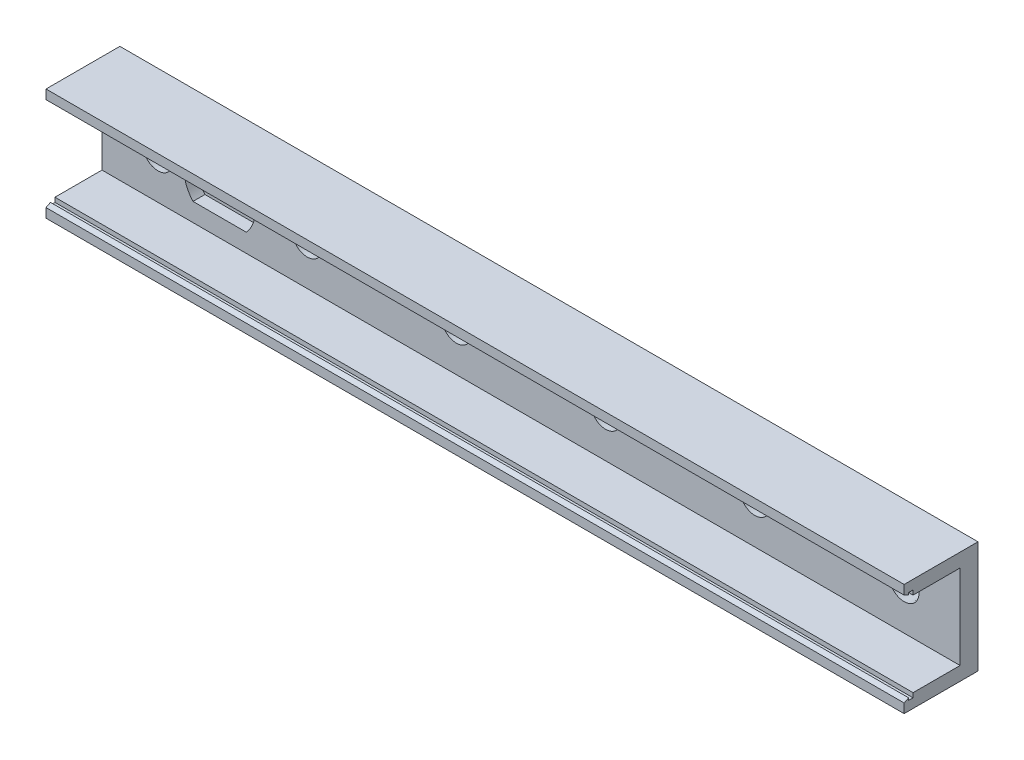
ISO-10303-21;
HEADER;
FILE_DESCRIPTION(('STEP AP214'),'2;1');
FILE_NAME('part.step','',(''),(''),'','','');
FILE_SCHEMA(('AUTOMOTIVE_DESIGN { 1 0 10303 214 1 1 1 1 }'));
ENDSEC;
DATA;
#1=APPLICATION_CONTEXT('core data for automotive mechanical design processes');
#2=APPLICATION_PROTOCOL_DEFINITION('international standard','automotive_design',2000,#1);
#3=PRODUCT_CONTEXT('',#1,'mechanical');
#4=PRODUCT('Part','Part','',(#3));
#5=PRODUCT_RELATED_PRODUCT_CATEGORY('part','',(#4));
#6=PRODUCT_DEFINITION_FORMATION('','',#4);
#7=PRODUCT_DEFINITION_CONTEXT('part definition',#1,'design');
#8=PRODUCT_DEFINITION('design','',#6,#7);
#9=PRODUCT_DEFINITION_SHAPE('','',#8);
#10=(LENGTH_UNIT() NAMED_UNIT(*) SI_UNIT(.MILLI.,.METRE.));
#11=(NAMED_UNIT(*) PLANE_ANGLE_UNIT() SI_UNIT($,.RADIAN.));
#12=(NAMED_UNIT(*) SI_UNIT($,.STERADIAN.) SOLID_ANGLE_UNIT());
#13=UNCERTAINTY_MEASURE_WITH_UNIT(LENGTH_MEASURE(1.E-05),#10,'distance_accuracy_value','');
#14=(GEOMETRIC_REPRESENTATION_CONTEXT(3) GLOBAL_UNCERTAINTY_ASSIGNED_CONTEXT((#13)) GLOBAL_UNIT_ASSIGNED_CONTEXT((#10,
#11,#12)) REPRESENTATION_CONTEXT('',''));
#15=CARTESIAN_POINT('',(0.,0.,0.));
#16=DIRECTION('',(0.,0.,1.));
#17=DIRECTION('',(1.,0.,0.));
#18=AXIS2_PLACEMENT_3D('',#15,#16,#17);
#19=CARTESIAN_POINT('',(0.,0.,3.048));
#20=DIRECTION('',(0.,0.,-1.));
#21=DIRECTION('',(-1.,0.,0.));
#22=AXIS2_PLACEMENT_3D('',#19,#20,#21);
#23=PLANE('',#22);
#24=DIRECTION('',(-1.,0.,0.));
#25=VECTOR('',#24,1.);
#26=CARTESIAN_POINT('',(15.4870030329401,13.589,3.048));
#27=LINE('',#26,#25);
#28=CARTESIAN_POINT('',(24.5743832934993,13.589,3.048));
#29=VERTEX_POINT('',#28);
#30=CARTESIAN_POINT('',(15.4870030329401,13.589,3.048));
#31=VERTEX_POINT('',#30);
#32=EDGE_CURVE('E293',#29,#31,#27,.T.);
#33=ORIENTED_EDGE('',*,*,#32,.F.);
#34=CARTESIAN_POINT('',(20.0306931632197,9.525,3.048));
#35=DIRECTION('',(0.,0.,1.));
#36=DIRECTION('',(1.,0.,0.));
#37=AXIS2_PLACEMENT_3D('',#34,#35,#36);
#38=CIRCLE('',#37,6.096);
#39=CARTESIAN_POINT('',(24.5743832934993,5.461,3.048));
#40=VERTEX_POINT('',#39);
#41=EDGE_CURVE('E296',#40,#29,#38,.T.);
#42=ORIENTED_EDGE('',*,*,#41,.F.);
#43=DIRECTION('',(1.,0.,0.));
#44=VECTOR('',#43,1.);
#45=CARTESIAN_POINT('',(15.4870030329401,5.461,3.048));
#46=LINE('',#45,#44);
#47=CARTESIAN_POINT('',(15.4870030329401,5.461,3.048));
#48=VERTEX_POINT('',#47);
#49=EDGE_CURVE('E286',#48,#40,#46,.T.);
#50=ORIENTED_EDGE('',*,*,#49,.F.);
#51=CARTESIAN_POINT('',(20.0306931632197,9.525,3.048));
#52=DIRECTION('',(0.,0.,1.));
#53=DIRECTION('',(1.,0.,0.));
#54=AXIS2_PLACEMENT_3D('',#51,#52,#53);
#55=CIRCLE('',#54,6.096);
#56=EDGE_CURVE('E290',#31,#48,#55,.T.);
#57=ORIENTED_EDGE('',*,*,#56,.F.);
#58=EDGE_LOOP('',(#33,#42,#50,#57));
#59=FACE_BOUND('',#58,.T.);
#60=CARTESIAN_POINT('',(9.525,9.525,3.048));
#61=DIRECTION('',(0.,0.,1.));
#62=DIRECTION('',(1.,0.,0.));
#63=AXIS2_PLACEMENT_3D('',#60,#61,#62);
#64=CIRCLE('',#63,2.54);
#65=CARTESIAN_POINT('',(12.065,9.525,3.048));
#66=VERTEX_POINT('',#65);
#67=EDGE_CURVE('E317',#66,#66,#64,.T.);
#68=ORIENTED_EDGE('',*,*,#67,.F.);
#69=EDGE_LOOP('',(#68));
#70=FACE_BOUND('',#69,.T.);
#71=CARTESIAN_POINT('',(34.925,9.525,3.048));
#72=DIRECTION('',(0.,0.,1.));
#73=DIRECTION('',(1.,0.,0.));
#74=AXIS2_PLACEMENT_3D('',#71,#72,#73);
#75=CIRCLE('',#74,2.54);
#76=CARTESIAN_POINT('',(37.465,9.525,3.048));
#77=VERTEX_POINT('',#76);
#78=EDGE_CURVE('E323',#77,#77,#75,.T.);
#79=ORIENTED_EDGE('',*,*,#78,.F.);
#80=EDGE_LOOP('',(#79));
#81=FACE_BOUND('',#80,.T.);
#82=CARTESIAN_POINT('',(60.325,9.525,3.048));
#83=DIRECTION('',(0.,0.,1.));
#84=DIRECTION('',(1.,0.,0.));
#85=AXIS2_PLACEMENT_3D('',#82,#83,#84);
#86=CIRCLE('',#85,2.54);
#87=CARTESIAN_POINT('',(62.865,9.525,3.048));
#88=VERTEX_POINT('',#87);
#89=EDGE_CURVE('E329',#88,#88,#86,.T.);
#90=ORIENTED_EDGE('',*,*,#89,.F.);
#91=EDGE_LOOP('',(#90));
#92=FACE_BOUND('',#91,.T.);
#93=CARTESIAN_POINT('',(85.725,9.525,3.048));
#94=DIRECTION('',(0.,0.,1.));
#95=DIRECTION('',(1.,0.,0.));
#96=AXIS2_PLACEMENT_3D('',#93,#94,#95);
#97=CIRCLE('',#96,2.54);
#98=CARTESIAN_POINT('',(88.265,9.525,3.048));
#99=VERTEX_POINT('',#98);
#100=EDGE_CURVE('E335',#99,#99,#97,.T.);
#101=ORIENTED_EDGE('',*,*,#100,.F.);
#102=EDGE_LOOP('',(#101));
#103=FACE_BOUND('',#102,.T.);
#104=CARTESIAN_POINT('',(111.125,9.525,3.048));
#105=DIRECTION('',(0.,0.,1.));
#106=DIRECTION('',(1.,0.,0.));
#107=AXIS2_PLACEMENT_3D('',#104,#105,#106);
#108=CIRCLE('',#107,2.54);
#109=CARTESIAN_POINT('',(113.665,9.525,3.048));
#110=VERTEX_POINT('',#109);
#111=EDGE_CURVE('E341',#110,#110,#108,.T.);
#112=ORIENTED_EDGE('',*,*,#111,.F.);
#113=EDGE_LOOP('',(#112));
#114=FACE_BOUND('',#113,.T.);
#115=CARTESIAN_POINT('',(136.525,9.525,3.048));
#116=DIRECTION('',(0.,0.,1.));
#117=DIRECTION('',(1.,0.,0.));
#118=AXIS2_PLACEMENT_3D('',#115,#116,#117);
#119=CIRCLE('',#118,2.54000000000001);
#120=CARTESIAN_POINT('',(139.065,9.525,3.048));
#121=VERTEX_POINT('',#120);
#122=EDGE_CURVE('E347',#121,#121,#119,.T.);
#123=ORIENTED_EDGE('',*,*,#122,.F.);
#124=EDGE_LOOP('',(#123));
#125=FACE_BOUND('',#124,.T.);
#126=DIRECTION('',(-1.,0.,0.));
#127=VECTOR('',#126,1.);
#128=CARTESIAN_POINT('',(146.05,2.33679999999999,3.048));
#129=LINE('',#128,#127);
#130=CARTESIAN_POINT('',(146.05,2.3368,3.048));
#131=VERTEX_POINT('',#130);
#132=CARTESIAN_POINT('',(0.,2.3368,3.048));
#133=VERTEX_POINT('',#132);
#134=EDGE_CURVE('E55',#131,#133,#129,.T.);
#135=ORIENTED_EDGE('',*,*,#134,.F.);
#136=DIRECTION('',(0.,1.,0.));
#137=VECTOR('',#136,1.);
#138=CARTESIAN_POINT('',(146.05,0.,3.048));
#139=LINE('',#138,#137);
#140=CARTESIAN_POINT('',(146.05,16.7132,3.048));
#141=VERTEX_POINT('',#140);
#142=EDGE_CURVE('E37',#131,#141,#139,.T.);
#143=ORIENTED_EDGE('',*,*,#142,.T.);
#144=DIRECTION('',(-1.,0.,0.));
#145=VECTOR('',#144,1.);
#146=CARTESIAN_POINT('',(146.05,16.7132,3.048));
#147=LINE('',#146,#145);
#148=CARTESIAN_POINT('',(0.,16.7132,3.048));
#149=VERTEX_POINT('',#148);
#150=EDGE_CURVE('E226',#141,#149,#147,.T.);
#151=ORIENTED_EDGE('',*,*,#150,.T.);
#152=DIRECTION('',(0.,-1.,0.));
#153=VECTOR('',#152,1.);
#154=CARTESIAN_POINT('',(0.,0.,3.048));
#155=LINE('',#154,#153);
#156=EDGE_CURVE('E51',#149,#133,#155,.T.);
#157=ORIENTED_EDGE('',*,*,#156,.T.);
#158=EDGE_LOOP('',(#135,#143,#151,#157));
#159=FACE_BOUND('',#158,.T.);
#160=ADVANCED_FACE('F33',(#59,#70,#81,#92,#103,#114,#125,#159),#23,.F.);
#161=CARTESIAN_POINT('',(0.,0.,3.048));
#162=DIRECTION('',(1.,0.,0.));
#163=DIRECTION('',(0.,0.,-1.));
#164=AXIS2_PLACEMENT_3D('',#161,#162,#163);
#165=PLANE('',#164);
#166=DIRECTION('',(0.,-1.,0.));
#167=VECTOR('',#166,1.);
#168=CARTESIAN_POINT('',(0.,0.,0.));
#169=LINE('',#168,#167);
#170=CARTESIAN_POINT('',(0.,19.05,0.));
#171=VERTEX_POINT('',#170);
#172=CARTESIAN_POINT('',(0.,0.,0.));
#173=VERTEX_POINT('',#172);
#174=EDGE_CURVE('E271',#171,#173,#169,.T.);
#175=ORIENTED_EDGE('',*,*,#174,.T.);
#176=DIRECTION('',(0.,0.,-1.));
#177=VECTOR('',#176,1.);
#178=CARTESIAN_POINT('',(0.,0.,3.048));
#179=LINE('',#178,#177);
#180=CARTESIAN_POINT('',(0.,0.,12.573));
#181=VERTEX_POINT('',#180);
#182=EDGE_CURVE('E11',#181,#173,#179,.T.);
#183=ORIENTED_EDGE('',*,*,#182,.F.);
#184=DIRECTION('',(0.,-1.,0.));
#185=VECTOR('',#184,1.);
#186=CARTESIAN_POINT('',(0.,0.,12.573));
#187=LINE('',#186,#185);
#188=CARTESIAN_POINT('',(0.,1.5748,12.573));
#189=VERTEX_POINT('',#188);
#190=EDGE_CURVE('E189',#189,#181,#187,.T.);
#191=ORIENTED_EDGE('',*,*,#190,.F.);
#192=DIRECTION('',(0.,-0.447213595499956,0.894427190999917));
#193=VECTOR('',#192,1.);
#194=CARTESIAN_POINT('',(0.,1.5748,12.573));
#195=LINE('',#194,#193);
#196=CARTESIAN_POINT('',(0.,1.9558,11.811));
#197=VERTEX_POINT('',#196);
#198=EDGE_CURVE('E494',#197,#189,#195,.T.);
#199=ORIENTED_EDGE('',*,*,#198,.F.);
#200=DIRECTION('',(0.,1.,0.));
#201=VECTOR('',#200,1.);
#202=CARTESIAN_POINT('',(0.,1.9558,11.811));
#203=LINE('',#202,#201);
#204=CARTESIAN_POINT('',(0.,1.5748,11.811));
#205=VERTEX_POINT('',#204);
#206=EDGE_CURVE('E507',#205,#197,#203,.T.);
#207=ORIENTED_EDGE('',*,*,#206,.F.);
#208=DIRECTION('',(0.,0.,1.));
#209=VECTOR('',#208,1.);
#210=CARTESIAN_POINT('',(0.,1.5748,11.811));
#211=LINE('',#210,#209);
#212=CARTESIAN_POINT('',(0.,1.5748,11.049));
#213=VERTEX_POINT('',#212);
#214=EDGE_CURVE('E510',#213,#205,#211,.T.);
#215=ORIENTED_EDGE('',*,*,#214,.F.);
#216=DIRECTION('',(0.,-1.,0.));
#217=VECTOR('',#216,1.);
#218=CARTESIAN_POINT('',(0.,2.3368,11.049));
#219=LINE('',#218,#217);
#220=CARTESIAN_POINT('',(0.,2.3368,11.049));
#221=VERTEX_POINT('',#220);
#222=EDGE_CURVE('E513',#221,#213,#219,.T.);
#223=ORIENTED_EDGE('',*,*,#222,.F.);
#224=DIRECTION('',(0.,0.,1.));
#225=VECTOR('',#224,1.);
#226=CARTESIAN_POINT('',(0.,2.3368,11.049));
#227=LINE('',#226,#225);
#228=EDGE_CURVE('E193',#133,#221,#227,.T.);
#229=ORIENTED_EDGE('',*,*,#228,.F.);
#230=ORIENTED_EDGE('',*,*,#156,.F.);
#231=DIRECTION('',(0.,0.,-1.));
#232=VECTOR('',#231,1.);
#233=CARTESIAN_POINT('',(0.,16.7132,11.049));
#234=LINE('',#233,#232);
#235=CARTESIAN_POINT('',(0.,16.7132,11.049));
#236=VERTEX_POINT('',#235);
#237=EDGE_CURVE('E205',#236,#149,#234,.T.);
#238=ORIENTED_EDGE('',*,*,#237,.F.);
#239=DIRECTION('',(0.,-1.,0.));
#240=VECTOR('',#239,1.);
#241=CARTESIAN_POINT('',(0.,16.7132,11.049));
#242=LINE('',#241,#240);
#243=CARTESIAN_POINT('',(0.,17.4752,11.049));
#244=VERTEX_POINT('',#243);
#245=EDGE_CURVE('E219',#244,#236,#242,.T.);
#246=ORIENTED_EDGE('',*,*,#245,.F.);
#247=DIRECTION('',(0.,0.,-1.));
#248=VECTOR('',#247,1.);
#249=CARTESIAN_POINT('',(0.,17.4752,11.811));
#250=LINE('',#249,#248);
#251=CARTESIAN_POINT('',(0.,17.4752,11.811));
#252=VERTEX_POINT('',#251);
#253=EDGE_CURVE('E217',#252,#244,#250,.T.);
#254=ORIENTED_EDGE('',*,*,#253,.F.);
#255=DIRECTION('',(0.,1.,0.));
#256=VECTOR('',#255,1.);
#257=CARTESIAN_POINT('',(0.,17.0942,11.811));
#258=LINE('',#257,#256);
#259=CARTESIAN_POINT('',(0.,17.0942,11.811));
#260=VERTEX_POINT('',#259);
#261=EDGE_CURVE('E215',#260,#252,#258,.T.);
#262=ORIENTED_EDGE('',*,*,#261,.F.);
#263=DIRECTION('',(0.,-0.447213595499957,-0.894427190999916));
#264=VECTOR('',#263,1.);
#265=CARTESIAN_POINT('',(0.,17.4752,12.573));
#266=LINE('',#265,#264);
#267=CARTESIAN_POINT('',(0.,17.4752,12.573));
#268=VERTEX_POINT('',#267);
#269=EDGE_CURVE('E196',#268,#260,#266,.T.);
#270=ORIENTED_EDGE('',*,*,#269,.F.);
#271=DIRECTION('',(0.,-1.,0.));
#272=VECTOR('',#271,1.);
#273=CARTESIAN_POINT('',(0.,19.05,12.573));
#274=LINE('',#273,#272);
#275=CARTESIAN_POINT('',(0.,19.05,12.573));
#276=VERTEX_POINT('',#275);
#277=EDGE_CURVE('E194',#276,#268,#274,.T.);
#278=ORIENTED_EDGE('',*,*,#277,.F.);
#279=DIRECTION('',(0.,0.,-1.));
#280=VECTOR('',#279,1.);
#281=CARTESIAN_POINT('',(0.,19.05,3.048));
#282=LINE('',#281,#280);
#283=EDGE_CURVE('E246',#276,#171,#282,.T.);
#284=ORIENTED_EDGE('',*,*,#283,.T.);
#285=EDGE_LOOP('',(#175,#183,#191,#199,#207,#215,#223,#229,#230,#238,#246,#254,#262,#270,#278,#284));
#286=FACE_BOUND('',#285,.T.);
#287=ADVANCED_FACE('F35',(#286),#165,.F.);
#288=CARTESIAN_POINT('',(0.,0.,3.048));
#289=DIRECTION('',(0.,1.,0.));
#290=DIRECTION('',(0.,0.,1.));
#291=AXIS2_PLACEMENT_3D('',#288,#289,#290);
#292=PLANE('',#291);
#293=DIRECTION('',(1.,0.,0.));
#294=VECTOR('',#293,1.);
#295=CARTESIAN_POINT('',(0.,0.,0.));
#296=LINE('',#295,#294);
#297=CARTESIAN_POINT('',(146.05,0.,0.));
#298=VERTEX_POINT('',#297);
#299=EDGE_CURVE('E253',#173,#298,#296,.T.);
#300=ORIENTED_EDGE('',*,*,#299,.T.);
#301=DIRECTION('',(0.,0.,-1.));
#302=VECTOR('',#301,1.);
#303=CARTESIAN_POINT('',(146.05,0.,3.048));
#304=LINE('',#303,#302);
#305=CARTESIAN_POINT('',(146.05,0.,12.573));
#306=VERTEX_POINT('',#305);
#307=EDGE_CURVE('E43',#306,#298,#304,.T.);
#308=ORIENTED_EDGE('',*,*,#307,.F.);
#309=DIRECTION('',(-1.,0.,0.));
#310=VECTOR('',#309,1.);
#311=CARTESIAN_POINT('',(146.05,0.,12.573));
#312=LINE('',#311,#310);
#313=EDGE_CURVE('E490',#306,#181,#312,.T.);
#314=ORIENTED_EDGE('',*,*,#313,.T.);
#315=ORIENTED_EDGE('',*,*,#182,.T.);
#316=EDGE_LOOP('',(#300,#308,#314,#315));
#317=FACE_BOUND('',#316,.T.);
#318=ADVANCED_FACE('F396',(#317),#292,.F.);
#319=CARTESIAN_POINT('',(146.05,0.,3.048));
#320=DIRECTION('',(-1.,0.,0.));
#321=DIRECTION('',(0.,0.,1.));
#322=AXIS2_PLACEMENT_3D('',#319,#320,#321);
#323=PLANE('',#322);
#324=DIRECTION('',(0.,1.,0.));
#325=VECTOR('',#324,1.);
#326=CARTESIAN_POINT('',(146.05,0.,0.));
#327=LINE('',#326,#325);
#328=CARTESIAN_POINT('',(146.05,19.05,0.));
#329=VERTEX_POINT('',#328);
#330=EDGE_CURVE('E247',#298,#329,#327,.T.);
#331=ORIENTED_EDGE('',*,*,#330,.T.);
#332=DIRECTION('',(0.,0.,-1.));
#333=VECTOR('',#332,1.);
#334=CARTESIAN_POINT('',(146.05,19.05,3.048));
#335=LINE('',#334,#333);
#336=CARTESIAN_POINT('',(146.05,19.05,12.573));
#337=VERTEX_POINT('',#336);
#338=EDGE_CURVE('E258',#337,#329,#335,.T.);
#339=ORIENTED_EDGE('',*,*,#338,.F.);
#340=DIRECTION('',(0.,-1.,0.));
#341=VECTOR('',#340,1.);
#342=CARTESIAN_POINT('',(146.05,19.05,12.573));
#343=LINE('',#342,#341);
#344=CARTESIAN_POINT('',(146.05,17.4752,12.573));
#345=VERTEX_POINT('',#344);
#346=EDGE_CURVE('E202',#337,#345,#343,.T.);
#347=ORIENTED_EDGE('',*,*,#346,.T.);
#348=DIRECTION('',(0.,-0.447213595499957,-0.894427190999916));
#349=VECTOR('',#348,1.);
#350=CARTESIAN_POINT('',(146.05,17.4752,12.573));
#351=LINE('',#350,#349);
#352=CARTESIAN_POINT('',(146.05,17.0942,11.811));
#353=VERTEX_POINT('',#352);
#354=EDGE_CURVE('E204',#345,#353,#351,.T.);
#355=ORIENTED_EDGE('',*,*,#354,.T.);
#356=DIRECTION('',(0.,1.,0.));
#357=VECTOR('',#356,1.);
#358=CARTESIAN_POINT('',(146.05,17.0942,11.811));
#359=LINE('',#358,#357);
#360=CARTESIAN_POINT('',(146.05,17.4752,11.811));
#361=VERTEX_POINT('',#360);
#362=EDGE_CURVE('E207',#353,#361,#359,.T.);
#363=ORIENTED_EDGE('',*,*,#362,.T.);
#364=DIRECTION('',(0.,0.,-1.));
#365=VECTOR('',#364,1.);
#366=CARTESIAN_POINT('',(146.05,17.4752,11.811));
#367=LINE('',#366,#365);
#368=CARTESIAN_POINT('',(146.05,17.4752,11.049));
#369=VERTEX_POINT('',#368);
#370=EDGE_CURVE('E209',#361,#369,#367,.T.);
#371=ORIENTED_EDGE('',*,*,#370,.T.);
#372=DIRECTION('',(0.,-1.,0.));
#373=VECTOR('',#372,1.);
#374=CARTESIAN_POINT('',(146.05,16.7132,11.049));
#375=LINE('',#374,#373);
#376=CARTESIAN_POINT('',(146.05,16.7132,11.049));
#377=VERTEX_POINT('',#376);
#378=EDGE_CURVE('E211',#369,#377,#375,.T.);
#379=ORIENTED_EDGE('',*,*,#378,.T.);
#380=DIRECTION('',(0.,0.,-1.));
#381=VECTOR('',#380,1.);
#382=CARTESIAN_POINT('',(146.05,16.7132,11.049));
#383=LINE('',#382,#381);
#384=EDGE_CURVE('E212',#377,#141,#383,.T.);
#385=ORIENTED_EDGE('',*,*,#384,.T.);
#386=ORIENTED_EDGE('',*,*,#142,.F.);
#387=DIRECTION('',(0.,0.,1.));
#388=VECTOR('',#387,1.);
#389=CARTESIAN_POINT('',(146.05,2.3368,11.049));
#390=LINE('',#389,#388);
#391=CARTESIAN_POINT('',(146.05,2.3368,11.049));
#392=VERTEX_POINT('',#391);
#393=EDGE_CURVE('E183',#131,#392,#390,.T.);
#394=ORIENTED_EDGE('',*,*,#393,.T.);
#395=DIRECTION('',(0.,-1.,0.));
#396=VECTOR('',#395,1.);
#397=CARTESIAN_POINT('',(146.05,2.3368,11.049));
#398=LINE('',#397,#396);
#399=CARTESIAN_POINT('',(146.05,1.5748,11.049));
#400=VERTEX_POINT('',#399);
#401=EDGE_CURVE('E172',#392,#400,#398,.T.);
#402=ORIENTED_EDGE('',*,*,#401,.T.);
#403=DIRECTION('',(0.,0.,1.));
#404=VECTOR('',#403,1.);
#405=CARTESIAN_POINT('',(146.05,1.5748,11.811));
#406=LINE('',#405,#404);
#407=CARTESIAN_POINT('',(146.05,1.5748,11.811));
#408=VERTEX_POINT('',#407);
#409=EDGE_CURVE('E182',#400,#408,#406,.T.);
#410=ORIENTED_EDGE('',*,*,#409,.T.);
#411=DIRECTION('',(0.,1.,0.));
#412=VECTOR('',#411,1.);
#413=CARTESIAN_POINT('',(146.05,1.9558,11.811));
#414=LINE('',#413,#412);
#415=CARTESIAN_POINT('',(146.05,1.9558,11.811));
#416=VERTEX_POINT('',#415);
#417=EDGE_CURVE('E508',#408,#416,#414,.T.);
#418=ORIENTED_EDGE('',*,*,#417,.T.);
#419=DIRECTION('',(0.,-0.447213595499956,0.894427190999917));
#420=VECTOR('',#419,1.);
#421=CARTESIAN_POINT('',(146.05,1.5748,12.573));
#422=LINE('',#421,#420);
#423=CARTESIAN_POINT('',(146.05,1.5748,12.573));
#424=VERTEX_POINT('',#423);
#425=EDGE_CURVE('E519',#416,#424,#422,.T.);
#426=ORIENTED_EDGE('',*,*,#425,.T.);
#427=DIRECTION('',(0.,-1.,0.));
#428=VECTOR('',#427,1.);
#429=CARTESIAN_POINT('',(146.05,0.,12.573));
#430=LINE('',#429,#428);
#431=EDGE_CURVE('E264',#424,#306,#430,.T.);
#432=ORIENTED_EDGE('',*,*,#431,.T.);
#433=ORIENTED_EDGE('',*,*,#307,.T.);
#434=EDGE_LOOP('',(#331,#339,#347,#355,#363,#371,#379,#385,#386,#394,#402,#410,#418,#426,#432,#433));
#435=FACE_BOUND('',#434,.T.);
#436=ADVANCED_FACE('F186',(#435),#323,.F.);
#437=CARTESIAN_POINT('',(0.,19.05,3.048));
#438=DIRECTION('',(0.,-1.,0.));
#439=DIRECTION('',(0.,0.,-1.));
#440=AXIS2_PLACEMENT_3D('',#437,#438,#439);
#441=PLANE('',#440);
#442=DIRECTION('',(-1.,0.,0.));
#443=VECTOR('',#442,1.);
#444=CARTESIAN_POINT('',(0.,19.05,0.));
#445=LINE('',#444,#443);
#446=EDGE_CURVE('E245',#329,#171,#445,.T.);
#447=ORIENTED_EDGE('',*,*,#446,.T.);
#448=ORIENTED_EDGE('',*,*,#283,.F.);
#449=DIRECTION('',(-1.,0.,0.));
#450=VECTOR('',#449,1.);
#451=CARTESIAN_POINT('',(146.05,19.05,12.573));
#452=LINE('',#451,#450);
#453=EDGE_CURVE('E350',#337,#276,#452,.T.);
#454=ORIENTED_EDGE('',*,*,#453,.F.);
#455=ORIENTED_EDGE('',*,*,#338,.T.);
#456=EDGE_LOOP('',(#447,#448,#454,#455));
#457=FACE_BOUND('',#456,.T.);
#458=ADVANCED_FACE('F386',(#457),#441,.F.);
#459=CARTESIAN_POINT('',(0.,0.,0.));
#460=DIRECTION('',(0.,0.,-1.));
#461=DIRECTION('',(-1.,0.,0.));
#462=AXIS2_PLACEMENT_3D('',#459,#460,#461);
#463=PLANE('',#462);
#464=CARTESIAN_POINT('',(136.525,9.525,0.));
#465=DIRECTION('',(0.,0.,1.));
#466=DIRECTION('',(1.,0.,0.));
#467=AXIS2_PLACEMENT_3D('',#464,#465,#466);
#468=CIRCLE('',#467,2.69973891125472);
#469=CARTESIAN_POINT('',(139.224738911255,9.525,0.));
#470=VERTEX_POINT('',#469);
#471=EDGE_CURVE('E344',#470,#470,#468,.T.);
#472=ORIENTED_EDGE('',*,*,#471,.T.);
#473=EDGE_LOOP('',(#472));
#474=FACE_BOUND('',#473,.T.);
#475=CARTESIAN_POINT('',(111.125,9.525,0.));
#476=DIRECTION('',(0.,0.,1.));
#477=DIRECTION('',(1.,0.,0.));
#478=AXIS2_PLACEMENT_3D('',#475,#476,#477);
#479=CIRCLE('',#478,2.69973891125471);
#480=CARTESIAN_POINT('',(113.824738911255,9.525,0.));
#481=VERTEX_POINT('',#480);
#482=EDGE_CURVE('E338',#481,#481,#479,.T.);
#483=ORIENTED_EDGE('',*,*,#482,.T.);
#484=EDGE_LOOP('',(#483));
#485=FACE_BOUND('',#484,.T.);
#486=CARTESIAN_POINT('',(85.725,9.525,0.));
#487=DIRECTION('',(0.,0.,1.));
#488=DIRECTION('',(1.,0.,0.));
#489=AXIS2_PLACEMENT_3D('',#486,#487,#488);
#490=CIRCLE('',#489,2.69973891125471);
#491=CARTESIAN_POINT('',(88.4247389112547,9.525,0.));
#492=VERTEX_POINT('',#491);
#493=EDGE_CURVE('E332',#492,#492,#490,.T.);
#494=ORIENTED_EDGE('',*,*,#493,.T.);
#495=EDGE_LOOP('',(#494));
#496=FACE_BOUND('',#495,.T.);
#497=CARTESIAN_POINT('',(60.325,9.525,0.));
#498=DIRECTION('',(0.,0.,1.));
#499=DIRECTION('',(1.,0.,0.));
#500=AXIS2_PLACEMENT_3D('',#497,#498,#499);
#501=CIRCLE('',#500,2.69973891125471);
#502=CARTESIAN_POINT('',(63.0247389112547,9.525,0.));
#503=VERTEX_POINT('',#502);
#504=EDGE_CURVE('E326',#503,#503,#501,.T.);
#505=ORIENTED_EDGE('',*,*,#504,.T.);
#506=EDGE_LOOP('',(#505));
#507=FACE_BOUND('',#506,.T.);
#508=CARTESIAN_POINT('',(34.925,9.525,0.));
#509=DIRECTION('',(0.,0.,1.));
#510=DIRECTION('',(1.,0.,0.));
#511=AXIS2_PLACEMENT_3D('',#508,#509,#510);
#512=CIRCLE('',#511,2.69973891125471);
#513=CARTESIAN_POINT('',(37.6247389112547,9.525,0.));
#514=VERTEX_POINT('',#513);
#515=EDGE_CURVE('E320',#514,#514,#512,.T.);
#516=ORIENTED_EDGE('',*,*,#515,.T.);
#517=EDGE_LOOP('',(#516));
#518=FACE_BOUND('',#517,.T.);
#519=CARTESIAN_POINT('',(9.525,9.525,0.));
#520=DIRECTION('',(0.,0.,1.));
#521=DIRECTION('',(1.,0.,0.));
#522=AXIS2_PLACEMENT_3D('',#519,#520,#521);
#523=CIRCLE('',#522,2.69973891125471);
#524=CARTESIAN_POINT('',(12.2247389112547,9.525,0.));
#525=VERTEX_POINT('',#524);
#526=EDGE_CURVE('E312',#525,#525,#523,.T.);
#527=ORIENTED_EDGE('',*,*,#526,.T.);
#528=EDGE_LOOP('',(#527));
#529=FACE_BOUND('',#528,.T.);
#530=CARTESIAN_POINT('',(20.0306931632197,9.525,0.));
#531=DIRECTION('',(0.,0.,1.));
#532=DIRECTION('',(1.,0.,0.));
#533=AXIS2_PLACEMENT_3D('',#530,#531,#532);
#534=CIRCLE('',#533,3.556);
#535=CARTESIAN_POINT('',(23.5866931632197,9.525,0.));
#536=VERTEX_POINT('',#535);
#537=EDGE_CURVE('E298',#536,#536,#534,.T.);
#538=ORIENTED_EDGE('',*,*,#537,.T.);
#539=EDGE_LOOP('',(#538));
#540=FACE_BOUND('',#539,.T.);
#541=ORIENTED_EDGE('',*,*,#174,.F.);
#542=ORIENTED_EDGE('',*,*,#446,.F.);
#543=ORIENTED_EDGE('',*,*,#330,.F.);
#544=ORIENTED_EDGE('',*,*,#299,.F.);
#545=EDGE_LOOP('',(#541,#542,#543,#544));
#546=FACE_BOUND('',#545,.T.);
#547=ADVANCED_FACE('F270',(#474,#485,#496,#507,#518,#529,#540,#546),#463,.T.);
#548=CARTESIAN_POINT('',(20.0306931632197,9.525,1.016));
#549=DIRECTION('',(0.,0.,1.));
#550=DIRECTION('',(1.,0.,0.));
#551=AXIS2_PLACEMENT_3D('',#548,#549,#550);
#552=CYLINDRICAL_SURFACE('',#551,6.096);
#553=ORIENTED_EDGE('',*,*,#41,.T.);
#554=DIRECTION('',(0.,0.,1.));
#555=VECTOR('',#554,1.);
#556=CARTESIAN_POINT('',(24.5743832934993,13.589,1.016));
#557=LINE('',#556,#555);
#558=CARTESIAN_POINT('',(24.5743832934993,13.589,1.016));
#559=VERTEX_POINT('',#558);
#560=EDGE_CURVE('E279',#559,#29,#557,.T.);
#561=ORIENTED_EDGE('',*,*,#560,.F.);
#562=CARTESIAN_POINT('',(20.0306931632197,9.525,1.016));
#563=DIRECTION('',(0.,0.,1.));
#564=DIRECTION('',(1.,0.,0.));
#565=AXIS2_PLACEMENT_3D('',#562,#563,#564);
#566=CIRCLE('',#565,6.096);
#567=CARTESIAN_POINT('',(24.5743832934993,5.461,1.016));
#568=VERTEX_POINT('',#567);
#569=EDGE_CURVE('E289',#568,#559,#566,.T.);
#570=ORIENTED_EDGE('',*,*,#569,.F.);
#571=DIRECTION('',(0.,0.,1.));
#572=VECTOR('',#571,1.);
#573=CARTESIAN_POINT('',(24.5743832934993,5.461,1.016));
#574=LINE('',#573,#572);
#575=EDGE_CURVE('E272',#568,#40,#574,.T.);
#576=ORIENTED_EDGE('',*,*,#575,.T.);
#577=EDGE_LOOP('',(#553,#561,#570,#576));
#578=FACE_BOUND('',#577,.T.);
#579=ADVANCED_FACE('F393',(#578),#552,.F.);
#580=CARTESIAN_POINT('',(15.4870030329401,5.461,1.016));
#581=DIRECTION('',(0.,-1.,0.));
#582=DIRECTION('',(0.,0.,-1.));
#583=AXIS2_PLACEMENT_3D('',#580,#581,#582);
#584=PLANE('',#583);
#585=ORIENTED_EDGE('',*,*,#49,.T.);
#586=ORIENTED_EDGE('',*,*,#575,.F.);
#587=DIRECTION('',(1.,0.,0.));
#588=VECTOR('',#587,1.);
#589=CARTESIAN_POINT('',(15.4870030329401,5.461,1.016));
#590=LINE('',#589,#588);
#591=CARTESIAN_POINT('',(15.4870030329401,5.461,1.016));
#592=VERTEX_POINT('',#591);
#593=EDGE_CURVE('E283',#592,#568,#590,.T.);
#594=ORIENTED_EDGE('',*,*,#593,.F.);
#595=DIRECTION('',(0.,0.,1.));
#596=VECTOR('',#595,1.);
#597=CARTESIAN_POINT('',(15.4870030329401,5.461,1.016));
#598=LINE('',#597,#596);
#599=EDGE_CURVE('E274',#592,#48,#598,.T.);
#600=ORIENTED_EDGE('',*,*,#599,.T.);
#601=EDGE_LOOP('',(#585,#586,#594,#600));
#602=FACE_BOUND('',#601,.T.);
#603=ADVANCED_FACE('F409',(#602),#584,.F.);
#604=CARTESIAN_POINT('',(20.0306931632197,9.525,1.016));
#605=DIRECTION('',(0.,0.,1.));
#606=DIRECTION('',(1.,0.,0.));
#607=AXIS2_PLACEMENT_3D('',#604,#605,#606);
#608=CYLINDRICAL_SURFACE('',#607,6.096);
#609=ORIENTED_EDGE('',*,*,#56,.T.);
#610=ORIENTED_EDGE('',*,*,#599,.F.);
#611=CARTESIAN_POINT('',(20.0306931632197,9.525,1.016));
#612=DIRECTION('',(0.,0.,1.));
#613=DIRECTION('',(1.,0.,0.));
#614=AXIS2_PLACEMENT_3D('',#611,#612,#613);
#615=CIRCLE('',#614,6.096);
#616=CARTESIAN_POINT('',(15.4870030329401,13.589,1.016));
#617=VERTEX_POINT('',#616);
#618=EDGE_CURVE('E301',#617,#592,#615,.T.);
#619=ORIENTED_EDGE('',*,*,#618,.F.);
#620=DIRECTION('',(0.,0.,1.));
#621=VECTOR('',#620,1.);
#622=CARTESIAN_POINT('',(15.4870030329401,13.589,1.016));
#623=LINE('',#622,#621);
#624=EDGE_CURVE('E282',#617,#31,#623,.T.);
#625=ORIENTED_EDGE('',*,*,#624,.T.);
#626=EDGE_LOOP('',(#609,#610,#619,#625));
#627=FACE_BOUND('',#626,.T.);
#628=ADVANCED_FACE('F415',(#627),#608,.F.);
#629=CARTESIAN_POINT('',(15.4870030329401,13.589,1.016));
#630=DIRECTION('',(0.,1.,0.));
#631=DIRECTION('',(0.,0.,1.));
#632=AXIS2_PLACEMENT_3D('',#629,#630,#631);
#633=PLANE('',#632);
#634=ORIENTED_EDGE('',*,*,#32,.T.);
#635=ORIENTED_EDGE('',*,*,#624,.F.);
#636=DIRECTION('',(-1.,0.,0.));
#637=VECTOR('',#636,1.);
#638=CARTESIAN_POINT('',(15.4870030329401,13.589,1.016));
#639=LINE('',#638,#637);
#640=EDGE_CURVE('E304',#559,#617,#639,.T.);
#641=ORIENTED_EDGE('',*,*,#640,.F.);
#642=ORIENTED_EDGE('',*,*,#560,.T.);
#643=EDGE_LOOP('',(#634,#635,#641,#642));
#644=FACE_BOUND('',#643,.T.);
#645=ADVANCED_FACE('F411',(#644),#633,.F.);
#646=CARTESIAN_POINT('',(20.0306931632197,9.525,1.016));
#647=DIRECTION('',(0.,0.,1.));
#648=DIRECTION('',(1.,0.,0.));
#649=AXIS2_PLACEMENT_3D('',#646,#647,#648);
#650=PLANE('',#649);
#651=CARTESIAN_POINT('',(20.0306931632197,9.525,1.016));
#652=DIRECTION('',(0.,0.,1.));
#653=DIRECTION('',(1.,0.,0.));
#654=AXIS2_PLACEMENT_3D('',#651,#652,#653);
#655=CIRCLE('',#654,3.556);
#656=CARTESIAN_POINT('',(23.5866931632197,9.525,1.016));
#657=VERTEX_POINT('',#656);
#658=EDGE_CURVE('E309',#657,#657,#655,.T.);
#659=ORIENTED_EDGE('',*,*,#658,.F.);
#660=EDGE_LOOP('',(#659));
#661=FACE_BOUND('',#660,.T.);
#662=ORIENTED_EDGE('',*,*,#569,.T.);
#663=ORIENTED_EDGE('',*,*,#640,.T.);
#664=ORIENTED_EDGE('',*,*,#618,.T.);
#665=ORIENTED_EDGE('',*,*,#593,.T.);
#666=EDGE_LOOP('',(#662,#663,#664,#665));
#667=FACE_BOUND('',#666,.T.);
#668=ADVANCED_FACE('F414',(#661,#667),#650,.T.);
#669=CARTESIAN_POINT('',(20.0306931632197,9.525,0.));
#670=DIRECTION('',(0.,0.,1.));
#671=DIRECTION('',(1.,0.,0.));
#672=AXIS2_PLACEMENT_3D('',#669,#670,#671);
#673=CYLINDRICAL_SURFACE('',#672,3.556);
#674=ORIENTED_EDGE('',*,*,#537,.F.);
#675=EDGE_LOOP('',(#674));
#676=FACE_BOUND('',#675,.T.);
#677=ORIENTED_EDGE('',*,*,#658,.T.);
#678=EDGE_LOOP('',(#677));
#679=FACE_BOUND('',#678,.T.);
#680=ADVANCED_FACE('F425',(#676,#679),#673,.F.);
#681=CARTESIAN_POINT('',(9.525,9.525,3.048));
#682=DIRECTION('',(0.,0.,-1.));
#683=DIRECTION('',(1.,0.,0.));
#684=AXIS2_PLACEMENT_3D('',#681,#682,#683);
#685=CONICAL_SURFACE('',#684,2.54,0.05235987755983);
#686=ORIENTED_EDGE('',*,*,#526,.F.);
#687=EDGE_LOOP('',(#686));
#688=FACE_BOUND('',#687,.T.);
#689=ORIENTED_EDGE('',*,*,#67,.T.);
#690=EDGE_LOOP('',(#689));
#691=FACE_BOUND('',#690,.T.);
#692=ADVANCED_FACE('F429',(#688,#691),#685,.F.);
#693=CARTESIAN_POINT('',(34.925,9.525,3.048));
#694=DIRECTION('',(0.,0.,-1.));
#695=DIRECTION('',(1.,0.,0.));
#696=AXIS2_PLACEMENT_3D('',#693,#694,#695);
#697=CONICAL_SURFACE('',#696,2.54,0.05235987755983);
#698=ORIENTED_EDGE('',*,*,#515,.F.);
#699=EDGE_LOOP('',(#698));
#700=FACE_BOUND('',#699,.T.);
#701=ORIENTED_EDGE('',*,*,#78,.T.);
#702=EDGE_LOOP('',(#701));
#703=FACE_BOUND('',#702,.T.);
#704=ADVANCED_FACE('F433',(#700,#703),#697,.F.);
#705=CARTESIAN_POINT('',(60.325,9.525,3.048));
#706=DIRECTION('',(0.,0.,-1.));
#707=DIRECTION('',(1.,0.,0.));
#708=AXIS2_PLACEMENT_3D('',#705,#706,#707);
#709=CONICAL_SURFACE('',#708,2.54,0.05235987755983);
#710=ORIENTED_EDGE('',*,*,#504,.F.);
#711=EDGE_LOOP('',(#710));
#712=FACE_BOUND('',#711,.T.);
#713=ORIENTED_EDGE('',*,*,#89,.T.);
#714=EDGE_LOOP('',(#713));
#715=FACE_BOUND('',#714,.T.);
#716=ADVANCED_FACE('F437',(#712,#715),#709,.F.);
#717=CARTESIAN_POINT('',(85.725,9.525,3.048));
#718=DIRECTION('',(0.,0.,-1.));
#719=DIRECTION('',(1.,0.,0.));
#720=AXIS2_PLACEMENT_3D('',#717,#718,#719);
#721=CONICAL_SURFACE('',#720,2.54,0.05235987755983);
#722=ORIENTED_EDGE('',*,*,#493,.F.);
#723=EDGE_LOOP('',(#722));
#724=FACE_BOUND('',#723,.T.);
#725=ORIENTED_EDGE('',*,*,#100,.T.);
#726=EDGE_LOOP('',(#725));
#727=FACE_BOUND('',#726,.T.);
#728=ADVANCED_FACE('F441',(#724,#727),#721,.F.);
#729=CARTESIAN_POINT('',(111.125,9.525,3.048));
#730=DIRECTION('',(0.,0.,-1.));
#731=DIRECTION('',(1.,0.,0.));
#732=AXIS2_PLACEMENT_3D('',#729,#730,#731);
#733=CONICAL_SURFACE('',#732,2.54,0.05235987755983);
#734=ORIENTED_EDGE('',*,*,#482,.F.);
#735=EDGE_LOOP('',(#734));
#736=FACE_BOUND('',#735,.T.);
#737=ORIENTED_EDGE('',*,*,#111,.T.);
#738=EDGE_LOOP('',(#737));
#739=FACE_BOUND('',#738,.T.);
#740=ADVANCED_FACE('F445',(#736,#739),#733,.F.);
#741=CARTESIAN_POINT('',(136.525,9.525,3.048));
#742=DIRECTION('',(0.,0.,-1.));
#743=DIRECTION('',(1.,0.,0.));
#744=AXIS2_PLACEMENT_3D('',#741,#742,#743);
#745=CONICAL_SURFACE('',#744,2.54000000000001,0.05235987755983);
#746=ORIENTED_EDGE('',*,*,#471,.F.);
#747=EDGE_LOOP('',(#746));
#748=FACE_BOUND('',#747,.T.);
#749=ORIENTED_EDGE('',*,*,#122,.T.);
#750=EDGE_LOOP('',(#749));
#751=FACE_BOUND('',#750,.T.);
#752=ADVANCED_FACE('F449',(#748,#751),#745,.F.);
#753=CARTESIAN_POINT('',(146.05,19.05,12.573));
#754=DIRECTION('',(0.,0.,-1.));
#755=DIRECTION('',(-1.,0.,0.));
#756=AXIS2_PLACEMENT_3D('',#753,#754,#755);
#757=PLANE('',#756);
#758=ORIENTED_EDGE('',*,*,#277,.T.);
#759=DIRECTION('',(-1.,0.,0.));
#760=VECTOR('',#759,1.);
#761=CARTESIAN_POINT('',(146.05,17.4752,12.573));
#762=LINE('',#761,#760);
#763=EDGE_CURVE('E353',#345,#268,#762,.T.);
#764=ORIENTED_EDGE('',*,*,#763,.F.);
#765=ORIENTED_EDGE('',*,*,#346,.F.);
#766=ORIENTED_EDGE('',*,*,#453,.T.);
#767=EDGE_LOOP('',(#758,#764,#765,#766));
#768=FACE_BOUND('',#767,.T.);
#769=ADVANCED_FACE('F383',(#768),#757,.F.);
#770=CARTESIAN_POINT('',(146.05,17.4752,12.573));
#771=DIRECTION('',(0.,0.894427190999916,-0.447213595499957));
#772=DIRECTION('',(0.,0.447213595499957,0.894427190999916));
#773=AXIS2_PLACEMENT_3D('',#770,#771,#772);
#774=PLANE('',#773);
#775=ORIENTED_EDGE('',*,*,#269,.T.);
#776=DIRECTION('',(-1.,0.,0.));
#777=VECTOR('',#776,1.);
#778=CARTESIAN_POINT('',(146.05,17.0942,11.811));
#779=LINE('',#778,#777);
#780=EDGE_CURVE('E356',#353,#260,#779,.T.);
#781=ORIENTED_EDGE('',*,*,#780,.F.);
#782=ORIENTED_EDGE('',*,*,#354,.F.);
#783=ORIENTED_EDGE('',*,*,#763,.T.);
#784=EDGE_LOOP('',(#775,#781,#782,#783));
#785=FACE_BOUND('',#784,.T.);
#786=ADVANCED_FACE('F379',(#785),#774,.F.);
#787=CARTESIAN_POINT('',(146.05,17.0942,11.811));
#788=DIRECTION('',(0.,0.,1.));
#789=DIRECTION('',(1.,0.,0.));
#790=AXIS2_PLACEMENT_3D('',#787,#788,#789);
#791=PLANE('',#790);
#792=ORIENTED_EDGE('',*,*,#261,.T.);
#793=DIRECTION('',(-1.,0.,0.));
#794=VECTOR('',#793,1.);
#795=CARTESIAN_POINT('',(146.05,17.4752,11.811));
#796=LINE('',#795,#794);
#797=EDGE_CURVE('E359',#361,#252,#796,.T.);
#798=ORIENTED_EDGE('',*,*,#797,.F.);
#799=ORIENTED_EDGE('',*,*,#362,.F.);
#800=ORIENTED_EDGE('',*,*,#780,.T.);
#801=EDGE_LOOP('',(#792,#798,#799,#800));
#802=FACE_BOUND('',#801,.T.);
#803=ADVANCED_FACE('F375',(#802),#791,.F.);
#804=CARTESIAN_POINT('',(146.05,17.4752,11.811));
#805=DIRECTION('',(0.,1.,0.));
#806=DIRECTION('',(0.,0.,1.));
#807=AXIS2_PLACEMENT_3D('',#804,#805,#806);
#808=PLANE('',#807);
#809=ORIENTED_EDGE('',*,*,#253,.T.);
#810=DIRECTION('',(-1.,0.,0.));
#811=VECTOR('',#810,1.);
#812=CARTESIAN_POINT('',(146.05,17.4752,11.049));
#813=LINE('',#812,#811);
#814=EDGE_CURVE('E361',#369,#244,#813,.T.);
#815=ORIENTED_EDGE('',*,*,#814,.F.);
#816=ORIENTED_EDGE('',*,*,#370,.F.);
#817=ORIENTED_EDGE('',*,*,#797,.T.);
#818=EDGE_LOOP('',(#809,#815,#816,#817));
#819=FACE_BOUND('',#818,.T.);
#820=ADVANCED_FACE('F370',(#819),#808,.F.);
#821=CARTESIAN_POINT('',(146.05,16.7132,11.049));
#822=DIRECTION('',(0.,0.,-1.));
#823=DIRECTION('',(-1.,0.,0.));
#824=AXIS2_PLACEMENT_3D('',#821,#822,#823);
#825=PLANE('',#824);
#826=ORIENTED_EDGE('',*,*,#245,.T.);
#827=DIRECTION('',(-1.,0.,0.));
#828=VECTOR('',#827,1.);
#829=CARTESIAN_POINT('',(146.05,16.7132,11.049));
#830=LINE('',#829,#828);
#831=EDGE_CURVE('E223',#377,#236,#830,.T.);
#832=ORIENTED_EDGE('',*,*,#831,.F.);
#833=ORIENTED_EDGE('',*,*,#378,.F.);
#834=ORIENTED_EDGE('',*,*,#814,.T.);
#835=EDGE_LOOP('',(#826,#832,#833,#834));
#836=FACE_BOUND('',#835,.T.);
#837=ADVANCED_FACE('F365',(#836),#825,.F.);
#838=CARTESIAN_POINT('',(146.05,16.7132,11.049));
#839=DIRECTION('',(0.,1.,0.));
#840=DIRECTION('',(0.,0.,1.));
#841=AXIS2_PLACEMENT_3D('',#838,#839,#840);
#842=PLANE('',#841);
#843=ORIENTED_EDGE('',*,*,#237,.T.);
#844=ORIENTED_EDGE('',*,*,#150,.F.);
#845=ORIENTED_EDGE('',*,*,#384,.F.);
#846=ORIENTED_EDGE('',*,*,#831,.T.);
#847=EDGE_LOOP('',(#843,#844,#845,#846));
#848=FACE_BOUND('',#847,.T.);
#849=ADVANCED_FACE('F240',(#848),#842,.F.);
#850=CARTESIAN_POINT('',(146.05,2.3368,11.049));
#851=DIRECTION('',(0.,-1.,0.));
#852=DIRECTION('',(0.,0.,-1.));
#853=AXIS2_PLACEMENT_3D('',#850,#851,#852);
#854=PLANE('',#853);
#855=ORIENTED_EDGE('',*,*,#228,.T.);
#856=DIRECTION('',(-1.,0.,0.));
#857=VECTOR('',#856,1.);
#858=CARTESIAN_POINT('',(146.05,2.3368,11.049));
#859=LINE('',#858,#857);
#860=EDGE_CURVE('E176',#392,#221,#859,.T.);
#861=ORIENTED_EDGE('',*,*,#860,.F.);
#862=ORIENTED_EDGE('',*,*,#393,.F.);
#863=ORIENTED_EDGE('',*,*,#134,.T.);
#864=EDGE_LOOP('',(#855,#861,#862,#863));
#865=FACE_BOUND('',#864,.T.);
#866=ADVANCED_FACE('F191',(#865),#854,.F.);
#867=CARTESIAN_POINT('',(146.05,2.3368,11.049));
#868=DIRECTION('',(0.,0.,-1.));
#869=DIRECTION('',(-1.,0.,0.));
#870=AXIS2_PLACEMENT_3D('',#867,#868,#869);
#871=PLANE('',#870);
#872=ORIENTED_EDGE('',*,*,#222,.T.);
#873=DIRECTION('',(-1.,0.,0.));
#874=VECTOR('',#873,1.);
#875=CARTESIAN_POINT('',(146.05,1.5748,11.049));
#876=LINE('',#875,#874);
#877=EDGE_CURVE('E179',#400,#213,#876,.T.);
#878=ORIENTED_EDGE('',*,*,#877,.F.);
#879=ORIENTED_EDGE('',*,*,#401,.F.);
#880=ORIENTED_EDGE('',*,*,#860,.T.);
#881=EDGE_LOOP('',(#872,#878,#879,#880));
#882=FACE_BOUND('',#881,.T.);
#883=ADVANCED_FACE('F174',(#882),#871,.F.);
#884=CARTESIAN_POINT('',(146.05,1.5748,11.811));
#885=DIRECTION('',(0.,-1.,0.));
#886=DIRECTION('',(0.,0.,-1.));
#887=AXIS2_PLACEMENT_3D('',#884,#885,#886);
#888=PLANE('',#887);
#889=ORIENTED_EDGE('',*,*,#214,.T.);
#890=DIRECTION('',(-1.,0.,0.));
#891=VECTOR('',#890,1.);
#892=CARTESIAN_POINT('',(146.05,1.5748,11.811));
#893=LINE('',#892,#891);
#894=EDGE_CURVE('E198',#408,#205,#893,.T.);
#895=ORIENTED_EDGE('',*,*,#894,.F.);
#896=ORIENTED_EDGE('',*,*,#409,.F.);
#897=ORIENTED_EDGE('',*,*,#877,.T.);
#898=EDGE_LOOP('',(#889,#895,#896,#897));
#899=FACE_BOUND('',#898,.T.);
#900=ADVANCED_FACE('F470',(#899),#888,.F.);
#901=CARTESIAN_POINT('',(146.05,1.9558,11.811));
#902=DIRECTION('',(0.,0.,1.));
#903=DIRECTION('',(1.,0.,0.));
#904=AXIS2_PLACEMENT_3D('',#901,#902,#903);
#905=PLANE('',#904);
#906=ORIENTED_EDGE('',*,*,#206,.T.);
#907=DIRECTION('',(-1.,0.,0.));
#908=VECTOR('',#907,1.);
#909=CARTESIAN_POINT('',(146.05,1.9558,11.811));
#910=LINE('',#909,#908);
#911=EDGE_CURVE('E497',#416,#197,#910,.T.);
#912=ORIENTED_EDGE('',*,*,#911,.F.);
#913=ORIENTED_EDGE('',*,*,#417,.F.);
#914=ORIENTED_EDGE('',*,*,#894,.T.);
#915=EDGE_LOOP('',(#906,#912,#913,#914));
#916=FACE_BOUND('',#915,.T.);
#917=ADVANCED_FACE('F473',(#916),#905,.F.);
#918=CARTESIAN_POINT('',(146.05,1.5748,12.573));
#919=DIRECTION('',(0.,-0.894427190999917,-0.447213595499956));
#920=DIRECTION('',(0.,0.447213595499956,-0.894427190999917));
#921=AXIS2_PLACEMENT_3D('',#918,#919,#920);
#922=PLANE('',#921);
#923=ORIENTED_EDGE('',*,*,#198,.T.);
#924=DIRECTION('',(-1.,0.,0.));
#925=VECTOR('',#924,1.);
#926=CARTESIAN_POINT('',(146.05,1.5748,12.573));
#927=LINE('',#926,#925);
#928=EDGE_CURVE('E492',#424,#189,#927,.T.);
#929=ORIENTED_EDGE('',*,*,#928,.F.);
#930=ORIENTED_EDGE('',*,*,#425,.F.);
#931=ORIENTED_EDGE('',*,*,#911,.T.);
#932=EDGE_LOOP('',(#923,#929,#930,#931));
#933=FACE_BOUND('',#932,.T.);
#934=ADVANCED_FACE('F477',(#933),#922,.F.);
#935=CARTESIAN_POINT('',(146.05,0.,12.573));
#936=DIRECTION('',(0.,0.,-1.));
#937=DIRECTION('',(-1.,0.,0.));
#938=AXIS2_PLACEMENT_3D('',#935,#936,#937);
#939=PLANE('',#938);
#940=ORIENTED_EDGE('',*,*,#190,.T.);
#941=ORIENTED_EDGE('',*,*,#313,.F.);
#942=ORIENTED_EDGE('',*,*,#431,.F.);
#943=ORIENTED_EDGE('',*,*,#928,.T.);
#944=EDGE_LOOP('',(#940,#941,#942,#943));
#945=FACE_BOUND('',#944,.T.);
#946=ADVANCED_FACE('F481',(#945),#939,.F.);
#947=CLOSED_SHELL('',(#160,#287,#318,#436,#458,#547,#579,#603,#628,#645,#668,#680,#692,#704,
#716,#728,#740,#752,#769,#786,#803,#820,#837,#849,#866,#883,#900,#917,#934,#946));
#948=MANIFOLD_SOLID_BREP('B2',#947);
#949=ADVANCED_BREP_SHAPE_REPRESENTATION('',(#18,#948),#14);
#950=SHAPE_DEFINITION_REPRESENTATION(#9,#949);
ENDSEC;
END-ISO-10303-21;
